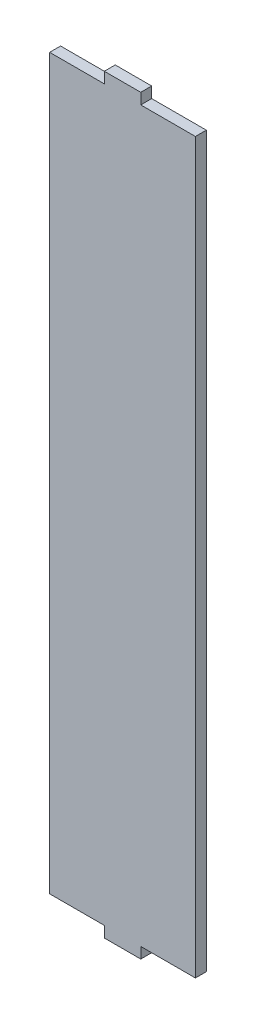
ISO-10303-21;
HEADER;
FILE_DESCRIPTION(('STEP AP214'),'2;1');
FILE_NAME('part.step','',(''),(''),'','','');
FILE_SCHEMA(('AUTOMOTIVE_DESIGN { 1 0 10303 214 1 1 1 1 }'));
ENDSEC;
DATA;
#1=APPLICATION_CONTEXT('core data for automotive mechanical design processes');
#2=APPLICATION_PROTOCOL_DEFINITION('international standard','automotive_design',2000,#1);
#3=PRODUCT_CONTEXT('',#1,'mechanical');
#4=PRODUCT('Part','Part','',(#3));
#5=PRODUCT_RELATED_PRODUCT_CATEGORY('part','',(#4));
#6=PRODUCT_DEFINITION_FORMATION('','',#4);
#7=PRODUCT_DEFINITION_CONTEXT('part definition',#1,'design');
#8=PRODUCT_DEFINITION('design','',#6,#7);
#9=PRODUCT_DEFINITION_SHAPE('','',#8);
#10=(LENGTH_UNIT() NAMED_UNIT(*) SI_UNIT(.MILLI.,.METRE.));
#11=(NAMED_UNIT(*) PLANE_ANGLE_UNIT() SI_UNIT($,.RADIAN.));
#12=(NAMED_UNIT(*) SI_UNIT($,.STERADIAN.) SOLID_ANGLE_UNIT());
#13=UNCERTAINTY_MEASURE_WITH_UNIT(LENGTH_MEASURE(1.E-05),#10,'distance_accuracy_value','');
#14=(GEOMETRIC_REPRESENTATION_CONTEXT(3) GLOBAL_UNCERTAINTY_ASSIGNED_CONTEXT((#13)) GLOBAL_UNIT_ASSIGNED_CONTEXT((#10,
#11,#12)) REPRESENTATION_CONTEXT('',''));
#15=CARTESIAN_POINT('',(0.,0.,0.));
#16=DIRECTION('',(0.,0.,1.));
#17=DIRECTION('',(1.,0.,0.));
#18=AXIS2_PLACEMENT_3D('',#15,#16,#17);
#19=CARTESIAN_POINT('',(-8.46153846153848,190.78290028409,3.));
#20=DIRECTION('',(0.,1.,0.));
#21=DIRECTION('',(0.,0.,1.));
#22=AXIS2_PLACEMENT_3D('',#19,#20,#21);
#23=PLANE('',#22);
#24=DIRECTION('',(1.,0.,0.));
#25=VECTOR('',#24,1.);
#26=CARTESIAN_POINT('',(-8.46153846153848,190.78290028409,0.));
#27=LINE('',#26,#25);
#28=CARTESIAN_POINT('',(-8.46153846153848,190.78290028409,0.));
#29=VERTEX_POINT('',#28);
#30=CARTESIAN_POINT('',(6.53846153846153,190.78290028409,0.));
#31=VERTEX_POINT('',#30);
#32=EDGE_CURVE('E155',#29,#31,#27,.T.);
#33=ORIENTED_EDGE('',*,*,#32,.F.);
#34=DIRECTION('',(0.,0.,-1.));
#35=VECTOR('',#34,1.);
#36=CARTESIAN_POINT('',(-8.46153846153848,190.78290028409,3.));
#37=LINE('',#36,#35);
#38=CARTESIAN_POINT('',(-8.46153846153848,190.78290028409,3.));
#39=VERTEX_POINT('',#38);
#40=EDGE_CURVE('E11',#39,#29,#37,.T.);
#41=ORIENTED_EDGE('',*,*,#40,.F.);
#42=DIRECTION('',(1.,0.,0.));
#43=VECTOR('',#42,1.);
#44=CARTESIAN_POINT('',(-8.46153846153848,190.78290028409,3.));
#45=LINE('',#44,#43);
#46=CARTESIAN_POINT('',(6.53846153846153,190.78290028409,3.));
#47=VERTEX_POINT('',#46);
#48=EDGE_CURVE('E183',#39,#47,#45,.T.);
#49=ORIENTED_EDGE('',*,*,#48,.T.);
#50=DIRECTION('',(0.,0.,-1.));
#51=VECTOR('',#50,1.);
#52=CARTESIAN_POINT('',(6.53846153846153,190.78290028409,3.));
#53=LINE('',#52,#51);
#54=EDGE_CURVE('E36',#47,#31,#53,.T.);
#55=ORIENTED_EDGE('',*,*,#54,.T.);
#56=EDGE_LOOP('',(#33,#41,#49,#55));
#57=FACE_BOUND('',#56,.T.);
#58=ADVANCED_FACE('F33',(#57),#23,.T.);
#59=CARTESIAN_POINT('',(-8.46153846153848,190.78290028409,3.));
#60=DIRECTION('',(-1.,0.,0.));
#61=DIRECTION('',(0.,0.,1.));
#62=AXIS2_PLACEMENT_3D('',#59,#60,#61);
#63=PLANE('',#62);
#64=DIRECTION('',(0.,1.,0.));
#65=VECTOR('',#64,1.);
#66=CARTESIAN_POINT('',(-8.46153846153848,190.78290028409,0.));
#67=LINE('',#66,#65);
#68=CARTESIAN_POINT('',(-8.46153846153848,193.78290028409,0.));
#69=VERTEX_POINT('',#68);
#70=EDGE_CURVE('E182',#29,#69,#67,.T.);
#71=ORIENTED_EDGE('',*,*,#70,.T.);
#72=DIRECTION('',(0.,0.,-1.));
#73=VECTOR('',#72,1.);
#74=CARTESIAN_POINT('',(-8.46153846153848,193.78290028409,3.));
#75=LINE('',#74,#73);
#76=CARTESIAN_POINT('',(-8.46153846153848,193.78290028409,3.));
#77=VERTEX_POINT('',#76);
#78=EDGE_CURVE('E42',#77,#69,#75,.T.);
#79=ORIENTED_EDGE('',*,*,#78,.F.);
#80=DIRECTION('',(0.,1.,0.));
#81=VECTOR('',#80,1.);
#82=CARTESIAN_POINT('',(-8.46153846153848,190.78290028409,3.));
#83=LINE('',#82,#81);
#84=EDGE_CURVE('E145',#39,#77,#83,.T.);
#85=ORIENTED_EDGE('',*,*,#84,.F.);
#86=ORIENTED_EDGE('',*,*,#40,.T.);
#87=EDGE_LOOP('',(#71,#79,#85,#86));
#88=FACE_BOUND('',#87,.T.);
#89=ADVANCED_FACE('F207',(#88),#63,.F.);
#90=CARTESIAN_POINT('',(-18.4615384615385,193.78290028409,3.));
#91=DIRECTION('',(0.,1.,0.));
#92=DIRECTION('',(0.,0.,1.));
#93=AXIS2_PLACEMENT_3D('',#90,#91,#92);
#94=PLANE('',#93);
#95=DIRECTION('',(1.,0.,0.));
#96=VECTOR('',#95,1.);
#97=CARTESIAN_POINT('',(-18.4615384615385,193.78290028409,0.));
#98=LINE('',#97,#96);
#99=CARTESIAN_POINT('',(-18.4615384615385,193.78290028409,0.));
#100=VERTEX_POINT('',#99);
#101=EDGE_CURVE('E131',#100,#69,#98,.T.);
#102=ORIENTED_EDGE('',*,*,#101,.F.);
#103=DIRECTION('',(0.,0.,-1.));
#104=VECTOR('',#103,1.);
#105=CARTESIAN_POINT('',(-18.4615384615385,193.78290028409,3.));
#106=LINE('',#105,#104);
#107=CARTESIAN_POINT('',(-18.4615384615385,193.78290028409,3.));
#108=VERTEX_POINT('',#107);
#109=EDGE_CURVE('E126',#108,#100,#106,.T.);
#110=ORIENTED_EDGE('',*,*,#109,.F.);
#111=DIRECTION('',(1.,0.,0.));
#112=VECTOR('',#111,1.);
#113=CARTESIAN_POINT('',(-18.4615384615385,193.78290028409,3.));
#114=LINE('',#113,#112);
#115=EDGE_CURVE('E129',#108,#77,#114,.T.);
#116=ORIENTED_EDGE('',*,*,#115,.T.);
#117=ORIENTED_EDGE('',*,*,#78,.T.);
#118=EDGE_LOOP('',(#102,#110,#116,#117));
#119=FACE_BOUND('',#118,.T.);
#120=ADVANCED_FACE('F128',(#119),#94,.T.);
#121=CARTESIAN_POINT('',(-18.4615384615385,190.78290028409,3.));
#122=DIRECTION('',(-1.,0.,0.));
#123=DIRECTION('',(0.,0.,1.));
#124=AXIS2_PLACEMENT_3D('',#121,#122,#123);
#125=PLANE('',#124);
#126=DIRECTION('',(0.,1.,0.));
#127=VECTOR('',#126,1.);
#128=CARTESIAN_POINT('',(-18.4615384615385,190.78290028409,0.));
#129=LINE('',#128,#127);
#130=CARTESIAN_POINT('',(-18.4615384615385,190.78290028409,0.));
#131=VERTEX_POINT('',#130);
#132=EDGE_CURVE('E179',#131,#100,#129,.T.);
#133=ORIENTED_EDGE('',*,*,#132,.F.);
#134=DIRECTION('',(0.,0.,-1.));
#135=VECTOR('',#134,1.);
#136=CARTESIAN_POINT('',(-18.4615384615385,190.78290028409,3.));
#137=LINE('',#136,#135);
#138=CARTESIAN_POINT('',(-18.4615384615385,190.78290028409,3.));
#139=VERTEX_POINT('',#138);
#140=EDGE_CURVE('E136',#139,#131,#137,.T.);
#141=ORIENTED_EDGE('',*,*,#140,.F.);
#142=DIRECTION('',(0.,1.,0.));
#143=VECTOR('',#142,1.);
#144=CARTESIAN_POINT('',(-18.4615384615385,190.78290028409,3.));
#145=LINE('',#144,#143);
#146=EDGE_CURVE('E143',#139,#108,#145,.T.);
#147=ORIENTED_EDGE('',*,*,#146,.T.);
#148=ORIENTED_EDGE('',*,*,#109,.T.);
#149=EDGE_LOOP('',(#133,#141,#147,#148));
#150=FACE_BOUND('',#149,.T.);
#151=ADVANCED_FACE('F147',(#150),#125,.T.);
#152=CARTESIAN_POINT('',(-33.4615384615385,190.78290028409,3.));
#153=DIRECTION('',(0.,1.,0.));
#154=DIRECTION('',(0.,0.,1.));
#155=AXIS2_PLACEMENT_3D('',#152,#153,#154);
#156=PLANE('',#155);
#157=DIRECTION('',(1.,0.,0.));
#158=VECTOR('',#157,1.);
#159=CARTESIAN_POINT('',(-33.4615384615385,190.78290028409,0.));
#160=LINE('',#159,#158);
#161=CARTESIAN_POINT('',(-33.4615384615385,190.78290028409,0.));
#162=VERTEX_POINT('',#161);
#163=EDGE_CURVE('E176',#162,#131,#160,.T.);
#164=ORIENTED_EDGE('',*,*,#163,.F.);
#165=DIRECTION('',(0.,0.,-1.));
#166=VECTOR('',#165,1.);
#167=CARTESIAN_POINT('',(-33.4615384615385,190.78290028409,3.));
#168=LINE('',#167,#166);
#169=CARTESIAN_POINT('',(-33.4615384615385,190.78290028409,3.));
#170=VERTEX_POINT('',#169);
#171=EDGE_CURVE('E187',#170,#162,#168,.T.);
#172=ORIENTED_EDGE('',*,*,#171,.F.);
#173=DIRECTION('',(1.,0.,0.));
#174=VECTOR('',#173,1.);
#175=CARTESIAN_POINT('',(-33.4615384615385,190.78290028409,3.));
#176=LINE('',#175,#174);
#177=EDGE_CURVE('E148',#170,#139,#176,.T.);
#178=ORIENTED_EDGE('',*,*,#177,.T.);
#179=ORIENTED_EDGE('',*,*,#140,.T.);
#180=EDGE_LOOP('',(#164,#172,#178,#179));
#181=FACE_BOUND('',#180,.T.);
#182=ADVANCED_FACE('F251',(#181),#156,.T.);
#183=CARTESIAN_POINT('',(-33.4615384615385,190.78290028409,3.));
#184=DIRECTION('',(1.,0.,0.));
#185=DIRECTION('',(0.,1.,0.));
#186=AXIS2_PLACEMENT_3D('',#183,#184,#185);
#187=PLANE('',#186);
#188=DIRECTION('',(0.,-1.,0.));
#189=VECTOR('',#188,1.);
#190=CARTESIAN_POINT('',(-33.4615384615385,190.78290028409,0.));
#191=LINE('',#190,#189);
#192=CARTESIAN_POINT('',(-33.4615384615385,-9.21709971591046,0.));
#193=VERTEX_POINT('',#192);
#194=EDGE_CURVE('E174',#162,#193,#191,.T.);
#195=ORIENTED_EDGE('',*,*,#194,.T.);
#196=DIRECTION('',(0.,0.,-1.));
#197=VECTOR('',#196,1.);
#198=CARTESIAN_POINT('',(-33.4615384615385,-9.21709971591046,3.));
#199=LINE('',#198,#197);
#200=CARTESIAN_POINT('',(-33.4615384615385,-9.21709971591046,3.));
#201=VERTEX_POINT('',#200);
#202=EDGE_CURVE('E189',#201,#193,#199,.T.);
#203=ORIENTED_EDGE('',*,*,#202,.F.);
#204=DIRECTION('',(0.,-1.,0.));
#205=VECTOR('',#204,1.);
#206=CARTESIAN_POINT('',(-33.4615384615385,190.78290028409,3.));
#207=LINE('',#206,#205);
#208=EDGE_CURVE('E150',#170,#201,#207,.T.);
#209=ORIENTED_EDGE('',*,*,#208,.F.);
#210=ORIENTED_EDGE('',*,*,#171,.T.);
#211=EDGE_LOOP('',(#195,#203,#209,#210));
#212=FACE_BOUND('',#211,.T.);
#213=ADVANCED_FACE('F227',(#212),#187,.F.);
#214=CARTESIAN_POINT('',(-33.4615384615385,-9.21709971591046,3.));
#215=DIRECTION('',(0.,1.,0.));
#216=DIRECTION('',(-1.,0.,0.));
#217=AXIS2_PLACEMENT_3D('',#214,#215,#216);
#218=PLANE('',#217);
#219=DIRECTION('',(1.,0.,0.));
#220=VECTOR('',#219,1.);
#221=CARTESIAN_POINT('',(-33.4615384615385,-9.21709971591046,0.));
#222=LINE('',#221,#220);
#223=CARTESIAN_POINT('',(-18.4615384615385,-9.21709971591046,0.));
#224=VERTEX_POINT('',#223);
#225=EDGE_CURVE('E172',#193,#224,#222,.T.);
#226=ORIENTED_EDGE('',*,*,#225,.T.);
#227=DIRECTION('',(0.,0.,-1.));
#228=VECTOR('',#227,1.);
#229=CARTESIAN_POINT('',(-18.4615384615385,-9.21709971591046,3.));
#230=LINE('',#229,#228);
#231=CARTESIAN_POINT('',(-18.4615384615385,-9.21709971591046,3.));
#232=VERTEX_POINT('',#231);
#233=EDGE_CURVE('E192',#232,#224,#230,.T.);
#234=ORIENTED_EDGE('',*,*,#233,.F.);
#235=DIRECTION('',(1.,0.,0.));
#236=VECTOR('',#235,1.);
#237=CARTESIAN_POINT('',(-33.4615384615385,-9.21709971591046,3.));
#238=LINE('',#237,#236);
#239=EDGE_CURVE('E221',#201,#232,#238,.T.);
#240=ORIENTED_EDGE('',*,*,#239,.F.);
#241=ORIENTED_EDGE('',*,*,#202,.T.);
#242=EDGE_LOOP('',(#226,#234,#240,#241));
#243=FACE_BOUND('',#242,.T.);
#244=ADVANCED_FACE('F231',(#243),#218,.F.);
#245=CARTESIAN_POINT('',(-18.4615384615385,-9.21709971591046,3.));
#246=DIRECTION('',(1.,0.,0.));
#247=DIRECTION('',(0.,0.,-1.));
#248=AXIS2_PLACEMENT_3D('',#245,#246,#247);
#249=PLANE('',#248);
#250=DIRECTION('',(0.,-1.,0.));
#251=VECTOR('',#250,1.);
#252=CARTESIAN_POINT('',(-18.4615384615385,-9.21709971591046,0.));
#253=LINE('',#252,#251);
#254=CARTESIAN_POINT('',(-18.4615384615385,-12.2170997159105,0.));
#255=VERTEX_POINT('',#254);
#256=EDGE_CURVE('E170',#224,#255,#253,.T.);
#257=ORIENTED_EDGE('',*,*,#256,.T.);
#258=DIRECTION('',(0.,0.,-1.));
#259=VECTOR('',#258,1.);
#260=CARTESIAN_POINT('',(-18.4615384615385,-12.2170997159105,3.));
#261=LINE('',#260,#259);
#262=CARTESIAN_POINT('',(-18.4615384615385,-12.2170997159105,3.));
#263=VERTEX_POINT('',#262);
#264=EDGE_CURVE('E195',#263,#255,#261,.T.);
#265=ORIENTED_EDGE('',*,*,#264,.F.);
#266=DIRECTION('',(0.,-1.,0.));
#267=VECTOR('',#266,1.);
#268=CARTESIAN_POINT('',(-18.4615384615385,-9.21709971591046,3.));
#269=LINE('',#268,#267);
#270=EDGE_CURVE('E219',#232,#263,#269,.T.);
#271=ORIENTED_EDGE('',*,*,#270,.F.);
#272=ORIENTED_EDGE('',*,*,#233,.T.);
#273=EDGE_LOOP('',(#257,#265,#271,#272));
#274=FACE_BOUND('',#273,.T.);
#275=ADVANCED_FACE('F236',(#274),#249,.F.);
#276=CARTESIAN_POINT('',(-18.4615384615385,-12.2170997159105,3.));
#277=DIRECTION('',(0.,1.,0.));
#278=DIRECTION('',(0.,0.,1.));
#279=AXIS2_PLACEMENT_3D('',#276,#277,#278);
#280=PLANE('',#279);
#281=DIRECTION('',(1.,0.,0.));
#282=VECTOR('',#281,1.);
#283=CARTESIAN_POINT('',(-18.4615384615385,-12.2170997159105,0.));
#284=LINE('',#283,#282);
#285=CARTESIAN_POINT('',(-8.46153846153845,-12.2170997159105,0.));
#286=VERTEX_POINT('',#285);
#287=EDGE_CURVE('E167',#255,#286,#284,.T.);
#288=ORIENTED_EDGE('',*,*,#287,.T.);
#289=DIRECTION('',(0.,0.,-1.));
#290=VECTOR('',#289,1.);
#291=CARTESIAN_POINT('',(-8.46153846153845,-12.2170997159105,3.));
#292=LINE('',#291,#290);
#293=CARTESIAN_POINT('',(-8.46153846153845,-12.2170997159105,3.));
#294=VERTEX_POINT('',#293);
#295=EDGE_CURVE('E198',#294,#286,#292,.T.);
#296=ORIENTED_EDGE('',*,*,#295,.F.);
#297=DIRECTION('',(1.,0.,0.));
#298=VECTOR('',#297,1.);
#299=CARTESIAN_POINT('',(-18.4615384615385,-12.2170997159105,3.));
#300=LINE('',#299,#298);
#301=EDGE_CURVE('E217',#263,#294,#300,.T.);
#302=ORIENTED_EDGE('',*,*,#301,.F.);
#303=ORIENTED_EDGE('',*,*,#264,.T.);
#304=EDGE_LOOP('',(#288,#296,#302,#303));
#305=FACE_BOUND('',#304,.T.);
#306=ADVANCED_FACE('F241',(#305),#280,.F.);
#307=CARTESIAN_POINT('',(-8.46153846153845,-9.21709971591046,3.));
#308=DIRECTION('',(1.,0.,0.));
#309=DIRECTION('',(0.,0.,-1.));
#310=AXIS2_PLACEMENT_3D('',#307,#308,#309);
#311=PLANE('',#310);
#312=DIRECTION('',(0.,-1.,0.));
#313=VECTOR('',#312,1.);
#314=CARTESIAN_POINT('',(-8.46153846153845,-9.21709971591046,0.));
#315=LINE('',#314,#313);
#316=CARTESIAN_POINT('',(-8.46153846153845,-9.21709971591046,0.));
#317=VERTEX_POINT('',#316);
#318=EDGE_CURVE('E164',#317,#286,#315,.T.);
#319=ORIENTED_EDGE('',*,*,#318,.F.);
#320=DIRECTION('',(0.,0.,-1.));
#321=VECTOR('',#320,1.);
#322=CARTESIAN_POINT('',(-8.46153846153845,-9.21709971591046,3.));
#323=LINE('',#322,#321);
#324=CARTESIAN_POINT('',(-8.46153846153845,-9.21709971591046,3.));
#325=VERTEX_POINT('',#324);
#326=EDGE_CURVE('E200',#325,#317,#323,.T.);
#327=ORIENTED_EDGE('',*,*,#326,.F.);
#328=DIRECTION('',(0.,-1.,0.));
#329=VECTOR('',#328,1.);
#330=CARTESIAN_POINT('',(-8.46153846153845,-9.21709971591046,3.));
#331=LINE('',#330,#329);
#332=EDGE_CURVE('E214',#325,#294,#331,.T.);
#333=ORIENTED_EDGE('',*,*,#332,.T.);
#334=ORIENTED_EDGE('',*,*,#295,.T.);
#335=EDGE_LOOP('',(#319,#327,#333,#334));
#336=FACE_BOUND('',#335,.T.);
#337=ADVANCED_FACE('F245',(#336),#311,.T.);
#338=CARTESIAN_POINT('',(-8.46153846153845,-9.21709971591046,3.));
#339=DIRECTION('',(0.,1.,0.));
#340=DIRECTION('',(0.,0.,1.));
#341=AXIS2_PLACEMENT_3D('',#338,#339,#340);
#342=PLANE('',#341);
#343=DIRECTION('',(1.,0.,0.));
#344=VECTOR('',#343,1.);
#345=CARTESIAN_POINT('',(-8.46153846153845,-9.21709971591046,0.));
#346=LINE('',#345,#344);
#347=CARTESIAN_POINT('',(6.53846153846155,-9.21709971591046,0.));
#348=VERTEX_POINT('',#347);
#349=EDGE_CURVE('E161',#317,#348,#346,.T.);
#350=ORIENTED_EDGE('',*,*,#349,.T.);
#351=DIRECTION('',(0.,0.,-1.));
#352=VECTOR('',#351,1.);
#353=CARTESIAN_POINT('',(6.53846153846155,-9.21709971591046,3.));
#354=LINE('',#353,#352);
#355=CARTESIAN_POINT('',(6.53846153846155,-9.21709971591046,3.));
#356=VERTEX_POINT('',#355);
#357=EDGE_CURVE('E201',#356,#348,#354,.T.);
#358=ORIENTED_EDGE('',*,*,#357,.F.);
#359=DIRECTION('',(1.,0.,0.));
#360=VECTOR('',#359,1.);
#361=CARTESIAN_POINT('',(-8.46153846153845,-9.21709971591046,3.));
#362=LINE('',#361,#360);
#363=EDGE_CURVE('E210',#325,#356,#362,.T.);
#364=ORIENTED_EDGE('',*,*,#363,.F.);
#365=ORIENTED_EDGE('',*,*,#326,.T.);
#366=EDGE_LOOP('',(#350,#358,#364,#365));
#367=FACE_BOUND('',#366,.T.);
#368=ADVANCED_FACE('F248',(#367),#342,.F.);
#369=CARTESIAN_POINT('',(6.53846153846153,190.78290028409,3.));
#370=DIRECTION('',(1.,0.,0.));
#371=DIRECTION('',(0.,1.,0.));
#372=AXIS2_PLACEMENT_3D('',#369,#370,#371);
#373=PLANE('',#372);
#374=DIRECTION('',(0.,-1.,0.));
#375=VECTOR('',#374,1.);
#376=CARTESIAN_POINT('',(6.53846153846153,190.78290028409,0.));
#377=LINE('',#376,#375);
#378=EDGE_CURVE('E158',#31,#348,#377,.T.);
#379=ORIENTED_EDGE('',*,*,#378,.F.);
#380=ORIENTED_EDGE('',*,*,#54,.F.);
#381=DIRECTION('',(0.,-1.,0.));
#382=VECTOR('',#381,1.);
#383=CARTESIAN_POINT('',(6.53846153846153,190.78290028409,3.));
#384=LINE('',#383,#382);
#385=EDGE_CURVE('E208',#47,#356,#384,.T.);
#386=ORIENTED_EDGE('',*,*,#385,.T.);
#387=ORIENTED_EDGE('',*,*,#357,.T.);
#388=EDGE_LOOP('',(#379,#380,#386,#387));
#389=FACE_BOUND('',#388,.T.);
#390=ADVANCED_FACE('F203',(#389),#373,.T.);
#391=CARTESIAN_POINT('',(0.,0.,3.));
#392=DIRECTION('',(0.,0.,-1.));
#393=DIRECTION('',(-1.,0.,0.));
#394=AXIS2_PLACEMENT_3D('',#391,#392,#393);
#395=PLANE('',#394);
#396=ORIENTED_EDGE('',*,*,#48,.F.);
#397=ORIENTED_EDGE('',*,*,#84,.T.);
#398=ORIENTED_EDGE('',*,*,#115,.F.);
#399=ORIENTED_EDGE('',*,*,#146,.F.);
#400=ORIENTED_EDGE('',*,*,#177,.F.);
#401=ORIENTED_EDGE('',*,*,#208,.T.);
#402=ORIENTED_EDGE('',*,*,#239,.T.);
#403=ORIENTED_EDGE('',*,*,#270,.T.);
#404=ORIENTED_EDGE('',*,*,#301,.T.);
#405=ORIENTED_EDGE('',*,*,#332,.F.);
#406=ORIENTED_EDGE('',*,*,#363,.T.);
#407=ORIENTED_EDGE('',*,*,#385,.F.);
#408=EDGE_LOOP('',(#396,#397,#398,#399,#400,#401,#402,#403,#404,#405,#406,#407));
#409=FACE_BOUND('',#408,.T.);
#410=ADVANCED_FACE('F141',(#409),#395,.F.);
#411=CARTESIAN_POINT('',(0.,0.,0.));
#412=DIRECTION('',(0.,0.,-1.));
#413=DIRECTION('',(-1.,0.,0.));
#414=AXIS2_PLACEMENT_3D('',#411,#412,#413);
#415=PLANE('',#414);
#416=ORIENTED_EDGE('',*,*,#32,.T.);
#417=ORIENTED_EDGE('',*,*,#378,.T.);
#418=ORIENTED_EDGE('',*,*,#349,.F.);
#419=ORIENTED_EDGE('',*,*,#318,.T.);
#420=ORIENTED_EDGE('',*,*,#287,.F.);
#421=ORIENTED_EDGE('',*,*,#256,.F.);
#422=ORIENTED_EDGE('',*,*,#225,.F.);
#423=ORIENTED_EDGE('',*,*,#194,.F.);
#424=ORIENTED_EDGE('',*,*,#163,.T.);
#425=ORIENTED_EDGE('',*,*,#132,.T.);
#426=ORIENTED_EDGE('',*,*,#101,.T.);
#427=ORIENTED_EDGE('',*,*,#70,.F.);
#428=EDGE_LOOP('',(#416,#417,#418,#419,#420,#421,#422,#423,#424,#425,#426,#427));
#429=FACE_BOUND('',#428,.T.);
#430=ADVANCED_FACE('F206',(#429),#415,.T.);
#431=CLOSED_SHELL('',(#58,#89,#120,#151,#182,#213,#244,#275,#306,#337,#368,#390,#410,#430));
#432=MANIFOLD_SOLID_BREP('B2',#431);
#433=ADVANCED_BREP_SHAPE_REPRESENTATION('',(#18,#432),#14);
#434=SHAPE_DEFINITION_REPRESENTATION(#9,#433);
ENDSEC;
END-ISO-10303-21;
